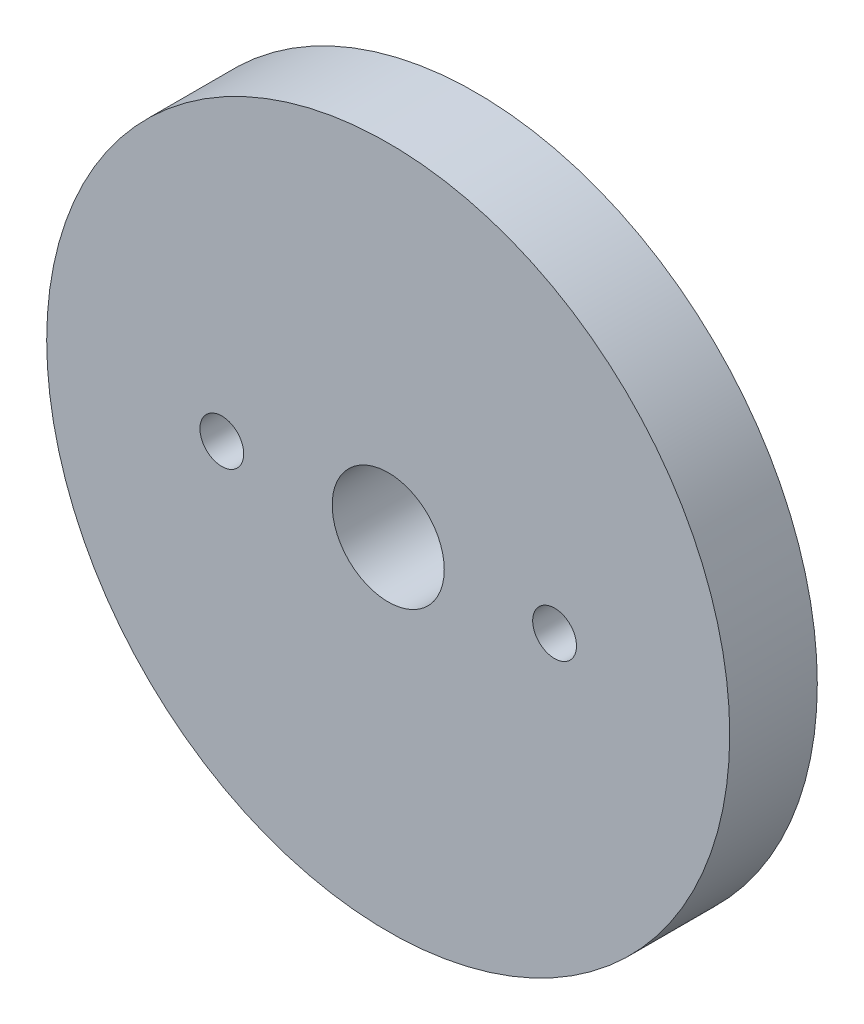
ISO-10303-21;
HEADER;
FILE_DESCRIPTION(('STEP AP214'),'2;1');
FILE_NAME('part.step','',(''),(''),'','','');
FILE_SCHEMA(('AUTOMOTIVE_DESIGN { 1 0 10303 214 1 1 1 1 }'));
ENDSEC;
DATA;
#1=APPLICATION_CONTEXT('core data for automotive mechanical design processes');
#2=APPLICATION_PROTOCOL_DEFINITION('international standard','automotive_design',2000,#1);
#3=PRODUCT_CONTEXT('',#1,'mechanical');
#4=PRODUCT('Part','Part','',(#3));
#5=PRODUCT_RELATED_PRODUCT_CATEGORY('part','',(#4));
#6=PRODUCT_DEFINITION_FORMATION('','',#4);
#7=PRODUCT_DEFINITION_CONTEXT('part definition',#1,'design');
#8=PRODUCT_DEFINITION('design','',#6,#7);
#9=PRODUCT_DEFINITION_SHAPE('','',#8);
#10=(LENGTH_UNIT() NAMED_UNIT(*) SI_UNIT(.MILLI.,.METRE.));
#11=(NAMED_UNIT(*) PLANE_ANGLE_UNIT() SI_UNIT($,.RADIAN.));
#12=(NAMED_UNIT(*) SI_UNIT($,.STERADIAN.) SOLID_ANGLE_UNIT());
#13=UNCERTAINTY_MEASURE_WITH_UNIT(LENGTH_MEASURE(1.E-05),#10,'distance_accuracy_value','');
#14=(GEOMETRIC_REPRESENTATION_CONTEXT(3) GLOBAL_UNCERTAINTY_ASSIGNED_CONTEXT((#13)) GLOBAL_UNIT_ASSIGNED_CONTEXT((#10,
#11,#12)) REPRESENTATION_CONTEXT('',''));
#15=CARTESIAN_POINT('',(0.,0.,0.));
#16=DIRECTION('',(0.,0.,1.));
#17=DIRECTION('',(1.,0.,0.));
#18=AXIS2_PLACEMENT_3D('',#15,#16,#17);
#19=CARTESIAN_POINT('',(0.,0.,0.));
#20=DIRECTION('',(0.,0.,-1.));
#21=DIRECTION('',(-1.,0.,0.));
#22=AXIS2_PLACEMENT_3D('',#19,#20,#21);
#23=CYLINDRICAL_SURFACE('',#22,19.5);
#24=CARTESIAN_POINT('',(0.,0.,0.));
#25=DIRECTION('',(0.,0.,-1.));
#26=DIRECTION('',(1.,0.,0.));
#27=AXIS2_PLACEMENT_3D('',#24,#25,#26);
#28=CIRCLE('',#27,19.5);
#29=CARTESIAN_POINT('',(19.5,0.,0.));
#30=VERTEX_POINT('',#29);
#31=EDGE_CURVE('E10',#30,#30,#28,.T.);
#32=ORIENTED_EDGE('',*,*,#31,.T.);
#33=EDGE_LOOP('',(#32));
#34=FACE_BOUND('',#33,.T.);
#35=CARTESIAN_POINT('',(0.,0.,-5.));
#36=DIRECTION('',(0.,0.,-1.));
#37=DIRECTION('',(1.,0.,0.));
#38=AXIS2_PLACEMENT_3D('',#35,#36,#37);
#39=CIRCLE('',#38,19.5);
#40=CARTESIAN_POINT('',(19.5,0.,-5.));
#41=VERTEX_POINT('',#40);
#42=EDGE_CURVE('E354',#41,#41,#39,.T.);
#43=ORIENTED_EDGE('',*,*,#42,.F.);
#44=EDGE_LOOP('',(#43));
#45=FACE_BOUND('',#44,.T.);
#46=ADVANCED_FACE('F348',(#34,#45),#23,.T.);
#47=CARTESIAN_POINT('',(0.,0.,0.));
#48=DIRECTION('',(0.,0.,1.));
#49=DIRECTION('',(1.,0.,0.));
#50=AXIS2_PLACEMENT_3D('',#47,#48,#49);
#51=PLANE('',#50);
#52=CARTESIAN_POINT('',(0.,0.,0.));
#53=DIRECTION('',(0.,0.,-1.));
#54=DIRECTION('',(1.,0.,0.));
#55=AXIS2_PLACEMENT_3D('',#52,#53,#54);
#56=CIRCLE('',#55,3.2);
#57=CARTESIAN_POINT('',(3.2,0.,0.));
#58=VERTEX_POINT('',#57);
#59=EDGE_CURVE('E373',#58,#58,#56,.T.);
#60=ORIENTED_EDGE('',*,*,#59,.T.);
#61=EDGE_LOOP('',(#60));
#62=FACE_BOUND('',#61,.T.);
#63=CARTESIAN_POINT('',(-9.5,0.,0.));
#64=DIRECTION('',(0.,0.,-1.));
#65=DIRECTION('',(1.,0.,0.));
#66=AXIS2_PLACEMENT_3D('',#63,#64,#65);
#67=CIRCLE('',#66,1.25);
#68=CARTESIAN_POINT('',(-8.25,0.,0.));
#69=VERTEX_POINT('',#68);
#70=EDGE_CURVE('E367',#69,#69,#67,.T.);
#71=ORIENTED_EDGE('',*,*,#70,.T.);
#72=EDGE_LOOP('',(#71));
#73=FACE_BOUND('',#72,.T.);
#74=CARTESIAN_POINT('',(9.5,0.,0.));
#75=DIRECTION('',(0.,0.,-1.));
#76=DIRECTION('',(1.,0.,0.));
#77=AXIS2_PLACEMENT_3D('',#74,#75,#76);
#78=CIRCLE('',#77,1.25);
#79=CARTESIAN_POINT('',(10.75,0.,0.));
#80=VERTEX_POINT('',#79);
#81=EDGE_CURVE('E358',#80,#80,#78,.T.);
#82=ORIENTED_EDGE('',*,*,#81,.T.);
#83=EDGE_LOOP('',(#82));
#84=FACE_BOUND('',#83,.T.);
#85=ORIENTED_EDGE('',*,*,#31,.F.);
#86=EDGE_LOOP('',(#85));
#87=FACE_BOUND('',#86,.T.);
#88=ADVANCED_FACE('F386',(#62,#73,#84,#87),#51,.T.);
#89=CARTESIAN_POINT('',(0.,0.,-5.));
#90=DIRECTION('',(0.,0.,1.));
#91=DIRECTION('',(1.,0.,0.));
#92=AXIS2_PLACEMENT_3D('',#89,#90,#91);
#93=PLANE('',#92);
#94=CARTESIAN_POINT('',(0.,0.,-5.));
#95=DIRECTION('',(0.,0.,-1.));
#96=DIRECTION('',(1.,0.,0.));
#97=AXIS2_PLACEMENT_3D('',#94,#95,#96);
#98=CIRCLE('',#97,3.2);
#99=CARTESIAN_POINT('',(3.2,0.,-5.));
#100=VERTEX_POINT('',#99);
#101=EDGE_CURVE('E376',#100,#100,#98,.T.);
#102=ORIENTED_EDGE('',*,*,#101,.F.);
#103=EDGE_LOOP('',(#102));
#104=FACE_BOUND('',#103,.T.);
#105=CARTESIAN_POINT('',(-9.5,0.,-5.));
#106=DIRECTION('',(0.,0.,-1.));
#107=DIRECTION('',(1.,0.,0.));
#108=AXIS2_PLACEMENT_3D('',#105,#106,#107);
#109=CIRCLE('',#108,1.25);
#110=CARTESIAN_POINT('',(-8.25,0.,-5.));
#111=VERTEX_POINT('',#110);
#112=EDGE_CURVE('E370',#111,#111,#109,.T.);
#113=ORIENTED_EDGE('',*,*,#112,.F.);
#114=EDGE_LOOP('',(#113));
#115=FACE_BOUND('',#114,.T.);
#116=CARTESIAN_POINT('',(9.5,0.,-5.));
#117=DIRECTION('',(0.,0.,-1.));
#118=DIRECTION('',(1.,0.,0.));
#119=AXIS2_PLACEMENT_3D('',#116,#117,#118);
#120=CIRCLE('',#119,1.25);
#121=CARTESIAN_POINT('',(10.75,0.,-5.));
#122=VERTEX_POINT('',#121);
#123=EDGE_CURVE('E362',#122,#122,#120,.T.);
#124=ORIENTED_EDGE('',*,*,#123,.F.);
#125=EDGE_LOOP('',(#124));
#126=FACE_BOUND('',#125,.T.);
#127=ORIENTED_EDGE('',*,*,#42,.T.);
#128=EDGE_LOOP('',(#127));
#129=FACE_BOUND('',#128,.T.);
#130=ADVANCED_FACE('F382',(#104,#115,#126,#129),#93,.F.);
#131=CARTESIAN_POINT('',(9.5,0.,0.));
#132=DIRECTION('',(0.,0.,-1.));
#133=DIRECTION('',(-1.,0.,0.));
#134=AXIS2_PLACEMENT_3D('',#131,#132,#133);
#135=CYLINDRICAL_SURFACE('',#134,1.25);
#136=ORIENTED_EDGE('',*,*,#81,.F.);
#137=EDGE_LOOP('',(#136));
#138=FACE_BOUND('',#137,.T.);
#139=ORIENTED_EDGE('',*,*,#123,.T.);
#140=EDGE_LOOP('',(#139));
#141=FACE_BOUND('',#140,.T.);
#142=ADVANCED_FACE('F385',(#138,#141),#135,.F.);
#143=CARTESIAN_POINT('',(-9.5,0.,0.));
#144=DIRECTION('',(0.,0.,-1.));
#145=DIRECTION('',(-1.,0.,0.));
#146=AXIS2_PLACEMENT_3D('',#143,#144,#145);
#147=CYLINDRICAL_SURFACE('',#146,1.25);
#148=ORIENTED_EDGE('',*,*,#70,.F.);
#149=EDGE_LOOP('',(#148));
#150=FACE_BOUND('',#149,.T.);
#151=ORIENTED_EDGE('',*,*,#112,.T.);
#152=EDGE_LOOP('',(#151));
#153=FACE_BOUND('',#152,.T.);
#154=ADVANCED_FACE('F393',(#150,#153),#147,.F.);
#155=CARTESIAN_POINT('',(0.,0.,0.));
#156=DIRECTION('',(0.,0.,-1.));
#157=DIRECTION('',(-1.,0.,0.));
#158=AXIS2_PLACEMENT_3D('',#155,#156,#157);
#159=CYLINDRICAL_SURFACE('',#158,3.2);
#160=ORIENTED_EDGE('',*,*,#59,.F.);
#161=EDGE_LOOP('',(#160));
#162=FACE_BOUND('',#161,.T.);
#163=ORIENTED_EDGE('',*,*,#101,.T.);
#164=EDGE_LOOP('',(#163));
#165=FACE_BOUND('',#164,.T.);
#166=ADVANCED_FACE('F380',(#162,#165),#159,.F.);
#167=CLOSED_SHELL('',(#46,#88,#130,#142,#154,#166));
#168=MANIFOLD_SOLID_BREP('B2',#167);
#169=ADVANCED_BREP_SHAPE_REPRESENTATION('',(#18,#168),#14);
#170=SHAPE_DEFINITION_REPRESENTATION(#9,#169);
ENDSEC;
END-ISO-10303-21;
